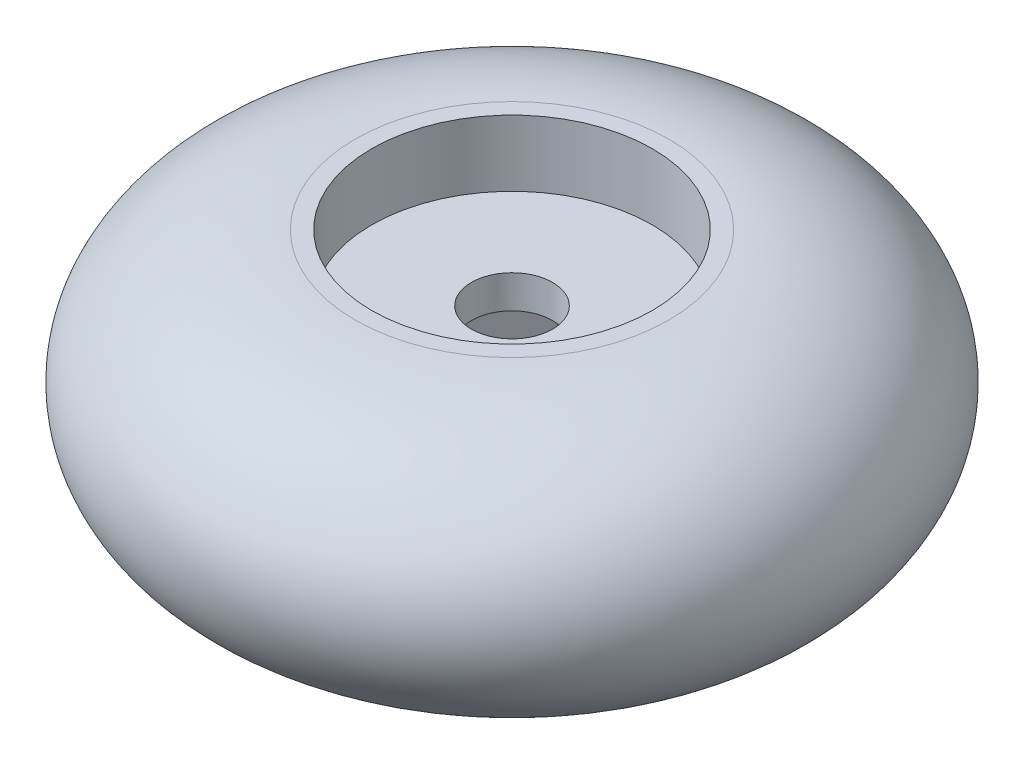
ISO-10303-21;
HEADER;
FILE_DESCRIPTION(('STEP AP214'),'2;1');
FILE_NAME('part.step','',(''),(''),'','','');
FILE_SCHEMA(('AUTOMOTIVE_DESIGN { 1 0 10303 214 1 1 1 1 }'));
ENDSEC;
DATA;
#1=APPLICATION_CONTEXT('core data for automotive mechanical design processes');
#2=APPLICATION_PROTOCOL_DEFINITION('international standard','automotive_design',2000,#1);
#3=PRODUCT_CONTEXT('',#1,'mechanical');
#4=PRODUCT('Part','Part','',(#3));
#5=PRODUCT_RELATED_PRODUCT_CATEGORY('part','',(#4));
#6=PRODUCT_DEFINITION_FORMATION('','',#4);
#7=PRODUCT_DEFINITION_CONTEXT('part definition',#1,'design');
#8=PRODUCT_DEFINITION('design','',#6,#7);
#9=PRODUCT_DEFINITION_SHAPE('','',#8);
#10=(LENGTH_UNIT() NAMED_UNIT(*) SI_UNIT(.MILLI.,.METRE.));
#11=(NAMED_UNIT(*) PLANE_ANGLE_UNIT() SI_UNIT($,.RADIAN.));
#12=(NAMED_UNIT(*) SI_UNIT($,.STERADIAN.) SOLID_ANGLE_UNIT());
#13=UNCERTAINTY_MEASURE_WITH_UNIT(LENGTH_MEASURE(1.E-05),#10,'distance_accuracy_value','');
#14=(GEOMETRIC_REPRESENTATION_CONTEXT(3) GLOBAL_UNCERTAINTY_ASSIGNED_CONTEXT((#13)) GLOBAL_UNIT_ASSIGNED_CONTEXT((#10,
#11,#12)) REPRESENTATION_CONTEXT('',''));
#15=CARTESIAN_POINT('',(0.,0.,0.));
#16=DIRECTION('',(0.,0.,1.));
#17=DIRECTION('',(1.,0.,0.));
#18=AXIS2_PLACEMENT_3D('',#15,#16,#17);
#19=CARTESIAN_POINT('',(9.5,0.,0.));
#20=DIRECTION('',(0.,-1.,0.));
#21=DIRECTION('',(1.,0.,0.));
#22=AXIS2_PLACEMENT_3D('',#19,#20,#21);
#23=PLANE('',#22);
#24=CARTESIAN_POINT('',(0.,0.,0.));
#25=DIRECTION('',(0.,1.,0.));
#26=DIRECTION('',(-1.,0.,0.));
#27=AXIS2_PLACEMENT_3D('',#24,#25,#26);
#28=CIRCLE('',#27,8.5);
#29=CARTESIAN_POINT('',(-8.5,0.,0.));
#30=VERTEX_POINT('',#29);
#31=EDGE_CURVE('E134',#30,#30,#28,.T.);
#32=ORIENTED_EDGE('',*,*,#31,.F.);
#33=EDGE_LOOP('',(#32));
#34=FACE_BOUND('',#33,.T.);
#35=CARTESIAN_POINT('',(0.,0.,0.));
#36=DIRECTION('',(0.,1.,0.));
#37=DIRECTION('',(-1.,0.,0.));
#38=AXIS2_PLACEMENT_3D('',#35,#36,#37);
#39=CIRCLE('',#38,9.5);
#40=CARTESIAN_POINT('',(-9.5,0.,0.));
#41=VERTEX_POINT('',#40);
#42=EDGE_CURVE('E11',#41,#41,#39,.T.);
#43=ORIENTED_EDGE('',*,*,#42,.T.);
#44=EDGE_LOOP('',(#43));
#45=FACE_BOUND('',#44,.T.);
#46=ADVANCED_FACE('F32',(#34,#45),#23,.F.);
#47=CARTESIAN_POINT('',(9.5,-8.,0.));
#48=DIRECTION('',(0.,0.,1.));
#49=DIRECTION('',(1.,0.,0.));
#50=AXIS2_PLACEMENT_3D('',#47,#48,#49);
#51=ELLIPSE('',#50,10.4754752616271,8.);
#52=TRIMMED_CURVE('',#51,(PARAMETER_VALUE(3.57656879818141)),
(PARAMETER_VALUE(8.98980181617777)),.T.,.PARAMETER.);
#53=CARTESIAN_POINT('',(0.,0.,0.));
#54=DIRECTION('',(0.,1.,0.));
#55=AXIS1_PLACEMENT('',#53,#54);
#56=SURFACE_OF_REVOLUTION('',#52,#55);
#57=ORIENTED_EDGE('',*,*,#42,.F.);
#58=EDGE_LOOP('',(#57));
#59=FACE_BOUND('',#58,.T.);
#60=CARTESIAN_POINT('',(0.,-16.,0.));
#61=DIRECTION('',(0.,1.,0.));
#62=DIRECTION('',(-1.,0.,0.));
#63=AXIS2_PLACEMENT_3D('',#60,#61,#62);
#64=CIRCLE('',#63,9.5);
#65=CARTESIAN_POINT('',(-9.5,-16.,0.));
#66=VERTEX_POINT('',#65);
#67=EDGE_CURVE('E40',#66,#66,#64,.T.);
#68=ORIENTED_EDGE('',*,*,#67,.T.);
#69=EDGE_LOOP('',(#68));
#70=FACE_BOUND('',#69,.T.);
#71=ADVANCED_FACE('F147',(#59,#70),#56,.T.);
#72=CARTESIAN_POINT('',(0.,-16.,0.));
#73=DIRECTION('',(0.,1.,0.));
#74=DIRECTION('',(-1.,0.,0.));
#75=AXIS2_PLACEMENT_3D('',#72,#73,#74);
#76=PLANE('',#75);
#77=DIRECTION('',(-0.500000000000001,0.,0.866025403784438));
#78=VECTOR('',#77,1.);
#79=CARTESIAN_POINT('',(7.5,-16.,0.));
#80=LINE('',#79,#78);
#81=CARTESIAN_POINT('',(7.5,-16.,0.));
#82=VERTEX_POINT('',#81);
#83=CARTESIAN_POINT('',(3.74999999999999,-16.,6.4951905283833));
#84=VERTEX_POINT('',#83);
#85=EDGE_CURVE('E121',#82,#84,#80,.T.);
#86=ORIENTED_EDGE('',*,*,#85,.F.);
#87=DIRECTION('',(0.499999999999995,0.,0.866025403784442));
#88=VECTOR('',#87,1.);
#89=CARTESIAN_POINT('',(3.75000000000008,-16.,-6.49519052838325));
#90=LINE('',#89,#88);
#91=CARTESIAN_POINT('',(3.75000000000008,-16.,-6.49519052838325));
#92=VERTEX_POINT('',#91);
#93=EDGE_CURVE('E47',#92,#82,#90,.T.);
#94=ORIENTED_EDGE('',*,*,#93,.F.);
#95=DIRECTION('',(1.,0.,0.));
#96=VECTOR('',#95,1.);
#97=CARTESIAN_POINT('',(-3.74999999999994,-16.,-6.49519052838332));
#98=LINE('',#97,#96);
#99=CARTESIAN_POINT('',(-3.74999999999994,-16.,-6.49519052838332));
#100=VERTEX_POINT('',#99);
#101=EDGE_CURVE('E130',#100,#92,#98,.T.);
#102=ORIENTED_EDGE('',*,*,#101,.F.);
#103=DIRECTION('',(0.500000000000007,0.,-0.866025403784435));
#104=VECTOR('',#103,1.);
#105=CARTESIAN_POINT('',(-7.5,-16.,0.));
#106=LINE('',#105,#104);
#107=CARTESIAN_POINT('',(-7.5,-16.,0.));
#108=VERTEX_POINT('',#107);
#109=EDGE_CURVE('E128',#108,#100,#106,.T.);
#110=ORIENTED_EDGE('',*,*,#109,.F.);
#111=DIRECTION('',(-0.499999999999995,0.,-0.866025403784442));
#112=VECTOR('',#111,1.);
#113=CARTESIAN_POINT('',(-3.75000000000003,-16.,6.49519052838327));
#114=LINE('',#113,#112);
#115=CARTESIAN_POINT('',(-3.75000000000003,-16.,6.49519052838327));
#116=VERTEX_POINT('',#115);
#117=EDGE_CURVE('E95',#116,#108,#114,.T.);
#118=ORIENTED_EDGE('',*,*,#117,.F.);
#119=DIRECTION('',(-1.,0.,0.));
#120=VECTOR('',#119,1.);
#121=CARTESIAN_POINT('',(3.74999999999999,-16.,6.4951905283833));
#122=LINE('',#121,#120);
#123=EDGE_CURVE('E124',#84,#116,#122,.T.);
#124=ORIENTED_EDGE('',*,*,#123,.F.);
#125=EDGE_LOOP('',(#86,#94,#102,#110,#118,#124));
#126=FACE_BOUND('',#125,.T.);
#127=ORIENTED_EDGE('',*,*,#67,.F.);
#128=EDGE_LOOP('',(#127));
#129=FACE_BOUND('',#128,.T.);
#130=ADVANCED_FACE('F150',(#126,#129),#76,.F.);
#131=CARTESIAN_POINT('',(0.,-4.,0.));
#132=DIRECTION('',(0.,1.,0.));
#133=DIRECTION('',(-1.,0.,0.));
#134=AXIS2_PLACEMENT_3D('',#131,#132,#133);
#135=CYLINDRICAL_SURFACE('',#134,8.5);
#136=CARTESIAN_POINT('',(0.,-4.,0.));
#137=DIRECTION('',(0.,1.,0.));
#138=DIRECTION('',(-1.,0.,0.));
#139=AXIS2_PLACEMENT_3D('',#136,#137,#138);
#140=CIRCLE('',#139,8.5);
#141=CARTESIAN_POINT('',(-8.5,-4.,0.));
#142=VERTEX_POINT('',#141);
#143=EDGE_CURVE('E140',#142,#142,#140,.T.);
#144=ORIENTED_EDGE('',*,*,#143,.F.);
#145=EDGE_LOOP('',(#144));
#146=FACE_BOUND('',#145,.T.);
#147=ORIENTED_EDGE('',*,*,#31,.T.);
#148=EDGE_LOOP('',(#147));
#149=FACE_BOUND('',#148,.T.);
#150=ADVANCED_FACE('F154',(#146,#149),#135,.F.);
#151=CARTESIAN_POINT('',(0.,-4.,0.));
#152=DIRECTION('',(0.,1.,0.));
#153=DIRECTION('',(-1.,0.,0.));
#154=AXIS2_PLACEMENT_3D('',#151,#152,#153);
#155=PLANE('',#154);
#156=CARTESIAN_POINT('',(0.,-4.,0.));
#157=DIRECTION('',(0.,1.,0.));
#158=DIRECTION('',(0.,0.,1.));
#159=AXIS2_PLACEMENT_3D('',#156,#157,#158);
#160=CIRCLE('',#159,2.45745);
#161=CARTESIAN_POINT('',(0.,-4.,2.45745));
#162=VERTEX_POINT('',#161);
#163=EDGE_CURVE('E280',#162,#162,#160,.T.);
#164=ORIENTED_EDGE('',*,*,#163,.F.);
#165=EDGE_LOOP('',(#164));
#166=FACE_BOUND('',#165,.T.);
#167=ORIENTED_EDGE('',*,*,#143,.T.);
#168=EDGE_LOOP('',(#167));
#169=FACE_BOUND('',#168,.T.);
#170=ADVANCED_FACE('F158',(#166,#169),#155,.T.);
#171=CARTESIAN_POINT('',(3.75000000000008,-6.,-6.49519052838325));
#172=DIRECTION('',(0.866025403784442,0.,-0.499999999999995));
#173=DIRECTION('',(-0.499999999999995,0.,-0.866025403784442));
#174=AXIS2_PLACEMENT_3D('',#171,#172,#173);
#175=PLANE('',#174);
#176=ORIENTED_EDGE('',*,*,#93,.T.);
#177=DIRECTION('',(0.,-1.,0.));
#178=VECTOR('',#177,1.);
#179=CARTESIAN_POINT('',(7.5,-6.,0.));
#180=LINE('',#179,#178);
#181=CARTESIAN_POINT('',(7.5,-6.,0.));
#182=VERTEX_POINT('',#181);
#183=EDGE_CURVE('E77',#182,#82,#180,.T.);
#184=ORIENTED_EDGE('',*,*,#183,.F.);
#185=DIRECTION('',(0.499999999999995,0.,0.866025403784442));
#186=VECTOR('',#185,1.);
#187=CARTESIAN_POINT('',(3.75000000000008,-6.,-6.49519052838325));
#188=LINE('',#187,#186);
#189=CARTESIAN_POINT('',(3.75000000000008,-6.,-6.49519052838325));
#190=VERTEX_POINT('',#189);
#191=EDGE_CURVE('E132',#190,#182,#188,.T.);
#192=ORIENTED_EDGE('',*,*,#191,.F.);
#193=DIRECTION('',(0.,-1.,0.));
#194=VECTOR('',#193,1.);
#195=CARTESIAN_POINT('',(3.75000000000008,-6.,-6.49519052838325));
#196=LINE('',#195,#194);
#197=EDGE_CURVE('E55',#190,#92,#196,.T.);
#198=ORIENTED_EDGE('',*,*,#197,.T.);
#199=EDGE_LOOP('',(#176,#184,#192,#198));
#200=FACE_BOUND('',#199,.T.);
#201=ADVANCED_FACE('F162',(#200),#175,.F.);
#202=CARTESIAN_POINT('',(-3.74999999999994,-6.,-6.49519052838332));
#203=DIRECTION('',(0.,0.,-1.));
#204=DIRECTION('',(-1.,0.,0.));
#205=AXIS2_PLACEMENT_3D('',#202,#203,#204);
#206=PLANE('',#205);
#207=ORIENTED_EDGE('',*,*,#101,.T.);
#208=ORIENTED_EDGE('',*,*,#197,.F.);
#209=DIRECTION('',(1.,0.,0.));
#210=VECTOR('',#209,1.);
#211=CARTESIAN_POINT('',(-3.74999999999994,-6.,-6.49519052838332));
#212=LINE('',#211,#210);
#213=CARTESIAN_POINT('',(-3.74999999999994,-6.,-6.49519052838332));
#214=VERTEX_POINT('',#213);
#215=EDGE_CURVE('E107',#214,#190,#212,.T.);
#216=ORIENTED_EDGE('',*,*,#215,.F.);
#217=DIRECTION('',(0.,-1.,0.));
#218=VECTOR('',#217,1.);
#219=CARTESIAN_POINT('',(-3.74999999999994,-6.,-6.49519052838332));
#220=LINE('',#219,#218);
#221=EDGE_CURVE('E99',#214,#100,#220,.T.);
#222=ORIENTED_EDGE('',*,*,#221,.T.);
#223=EDGE_LOOP('',(#207,#208,#216,#222));
#224=FACE_BOUND('',#223,.T.);
#225=ADVANCED_FACE('F166',(#224),#206,.F.);
#226=CARTESIAN_POINT('',(-7.5,-6.,0.));
#227=DIRECTION('',(-0.866025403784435,0.,-0.500000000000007));
#228=DIRECTION('',(-0.500000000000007,0.,0.866025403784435));
#229=AXIS2_PLACEMENT_3D('',#226,#227,#228);
#230=PLANE('',#229);
#231=ORIENTED_EDGE('',*,*,#109,.T.);
#232=ORIENTED_EDGE('',*,*,#221,.F.);
#233=DIRECTION('',(0.500000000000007,0.,-0.866025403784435));
#234=VECTOR('',#233,1.);
#235=CARTESIAN_POINT('',(-7.5,-6.,0.));
#236=LINE('',#235,#234);
#237=CARTESIAN_POINT('',(-7.5,-6.,0.));
#238=VERTEX_POINT('',#237);
#239=EDGE_CURVE('E103',#238,#214,#236,.T.);
#240=ORIENTED_EDGE('',*,*,#239,.F.);
#241=DIRECTION('',(0.,-1.,0.));
#242=VECTOR('',#241,1.);
#243=CARTESIAN_POINT('',(-7.5,-6.,0.));
#244=LINE('',#243,#242);
#245=EDGE_CURVE('E88',#238,#108,#244,.T.);
#246=ORIENTED_EDGE('',*,*,#245,.T.);
#247=EDGE_LOOP('',(#231,#232,#240,#246));
#248=FACE_BOUND('',#247,.T.);
#249=ADVANCED_FACE('F104',(#248),#230,.F.);
#250=CARTESIAN_POINT('',(-3.75000000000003,-6.,6.49519052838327));
#251=DIRECTION('',(-0.866025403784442,0.,0.499999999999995));
#252=DIRECTION('',(0.499999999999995,0.,0.866025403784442));
#253=AXIS2_PLACEMENT_3D('',#250,#251,#252);
#254=PLANE('',#253);
#255=ORIENTED_EDGE('',*,*,#117,.T.);
#256=ORIENTED_EDGE('',*,*,#245,.F.);
#257=DIRECTION('',(-0.499999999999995,0.,-0.866025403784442));
#258=VECTOR('',#257,1.);
#259=CARTESIAN_POINT('',(-3.75000000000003,-6.,6.49519052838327));
#260=LINE('',#259,#258);
#261=CARTESIAN_POINT('',(-3.75000000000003,-6.,6.49519052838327));
#262=VERTEX_POINT('',#261);
#263=EDGE_CURVE('E92',#262,#238,#260,.T.);
#264=ORIENTED_EDGE('',*,*,#263,.F.);
#265=DIRECTION('',(0.,-1.,0.));
#266=VECTOR('',#265,1.);
#267=CARTESIAN_POINT('',(-3.75000000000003,-6.,6.49519052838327));
#268=LINE('',#267,#266);
#269=EDGE_CURVE('E100',#262,#116,#268,.T.);
#270=ORIENTED_EDGE('',*,*,#269,.T.);
#271=EDGE_LOOP('',(#255,#256,#264,#270));
#272=FACE_BOUND('',#271,.T.);
#273=ADVANCED_FACE('F90',(#272),#254,.F.);
#274=CARTESIAN_POINT('',(3.74999999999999,-6.,6.4951905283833));
#275=DIRECTION('',(0.,0.,1.));
#276=DIRECTION('',(1.,0.,0.));
#277=AXIS2_PLACEMENT_3D('',#274,#275,#276);
#278=PLANE('',#277);
#279=ORIENTED_EDGE('',*,*,#123,.T.);
#280=ORIENTED_EDGE('',*,*,#269,.F.);
#281=DIRECTION('',(-1.,0.,0.));
#282=VECTOR('',#281,1.);
#283=CARTESIAN_POINT('',(3.74999999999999,-6.,6.4951905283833));
#284=LINE('',#283,#282);
#285=CARTESIAN_POINT('',(3.74999999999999,-6.,6.4951905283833));
#286=VERTEX_POINT('',#285);
#287=EDGE_CURVE('E113',#286,#262,#284,.T.);
#288=ORIENTED_EDGE('',*,*,#287,.F.);
#289=DIRECTION('',(0.,-1.,0.));
#290=VECTOR('',#289,1.);
#291=CARTESIAN_POINT('',(3.74999999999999,-6.,6.4951905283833));
#292=LINE('',#291,#290);
#293=EDGE_CURVE('E137',#286,#84,#292,.T.);
#294=ORIENTED_EDGE('',*,*,#293,.T.);
#295=EDGE_LOOP('',(#279,#280,#288,#294));
#296=FACE_BOUND('',#295,.T.);
#297=ADVANCED_FACE('F170',(#296),#278,.F.);
#298=CARTESIAN_POINT('',(7.5,-6.,0.));
#299=DIRECTION('',(0.866025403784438,0.,0.500000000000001));
#300=DIRECTION('',(0.500000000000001,0.,-0.866025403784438));
#301=AXIS2_PLACEMENT_3D('',#298,#299,#300);
#302=PLANE('',#301);
#303=ORIENTED_EDGE('',*,*,#85,.T.);
#304=ORIENTED_EDGE('',*,*,#293,.F.);
#305=DIRECTION('',(-0.500000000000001,0.,0.866025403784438));
#306=VECTOR('',#305,1.);
#307=CARTESIAN_POINT('',(7.5,-6.,0.));
#308=LINE('',#307,#306);
#309=EDGE_CURVE('E115',#182,#286,#308,.T.);
#310=ORIENTED_EDGE('',*,*,#309,.F.);
#311=ORIENTED_EDGE('',*,*,#183,.T.);
#312=EDGE_LOOP('',(#303,#304,#310,#311));
#313=FACE_BOUND('',#312,.T.);
#314=ADVANCED_FACE('F167',(#313),#302,.F.);
#315=CARTESIAN_POINT('',(0.,-6.,0.));
#316=DIRECTION('',(0.,-1.,0.));
#317=DIRECTION('',(0.,0.,-1.));
#318=AXIS2_PLACEMENT_3D('',#315,#316,#317);
#319=PLANE('',#318);
#320=CARTESIAN_POINT('',(0.,-6.,0.));
#321=DIRECTION('',(0.,-1.,0.));
#322=DIRECTION('',(0.,0.,-1.));
#323=AXIS2_PLACEMENT_3D('',#320,#321,#322);
#324=CIRCLE('',#323,2.45745);
#325=CARTESIAN_POINT('',(0.,-6.,-2.45745));
#326=VERTEX_POINT('',#325);
#327=EDGE_CURVE('E35',#326,#326,#324,.T.);
#328=ORIENTED_EDGE('',*,*,#327,.F.);
#329=EDGE_LOOP('',(#328));
#330=FACE_BOUND('',#329,.T.);
#331=ORIENTED_EDGE('',*,*,#191,.T.);
#332=ORIENTED_EDGE('',*,*,#309,.T.);
#333=ORIENTED_EDGE('',*,*,#287,.T.);
#334=ORIENTED_EDGE('',*,*,#263,.T.);
#335=ORIENTED_EDGE('',*,*,#239,.T.);
#336=ORIENTED_EDGE('',*,*,#215,.T.);
#337=EDGE_LOOP('',(#331,#332,#333,#334,#335,#336));
#338=FACE_BOUND('',#337,.T.);
#339=ADVANCED_FACE('F110',(#330,#338),#319,.T.);
#340=CARTESIAN_POINT('',(0.,-4.,0.));
#341=DIRECTION('',(0.,1.,0.));
#342=DIRECTION('',(0.,0.,1.));
#343=AXIS2_PLACEMENT_3D('',#340,#341,#342);
#344=CYLINDRICAL_SURFACE('',#343,2.45745);
#345=ORIENTED_EDGE('',*,*,#327,.T.);
#346=EDGE_LOOP('',(#345));
#347=FACE_BOUND('',#346,.T.);
#348=ORIENTED_EDGE('',*,*,#163,.T.);
#349=EDGE_LOOP('',(#348));
#350=FACE_BOUND('',#349,.T.);
#351=ADVANCED_FACE('F183',(#347,#350),#344,.F.);
#352=CLOSED_SHELL('',(#46,#71,#130,#150,#170,#201,#225,#249,#273,#297,#314,#339,#351));
#353=MANIFOLD_SOLID_BREP('B2',#352);
#354=ADVANCED_BREP_SHAPE_REPRESENTATION('',(#18,#353),#14);
#355=SHAPE_DEFINITION_REPRESENTATION(#9,#354);
ENDSEC;
END-ISO-10303-21;
